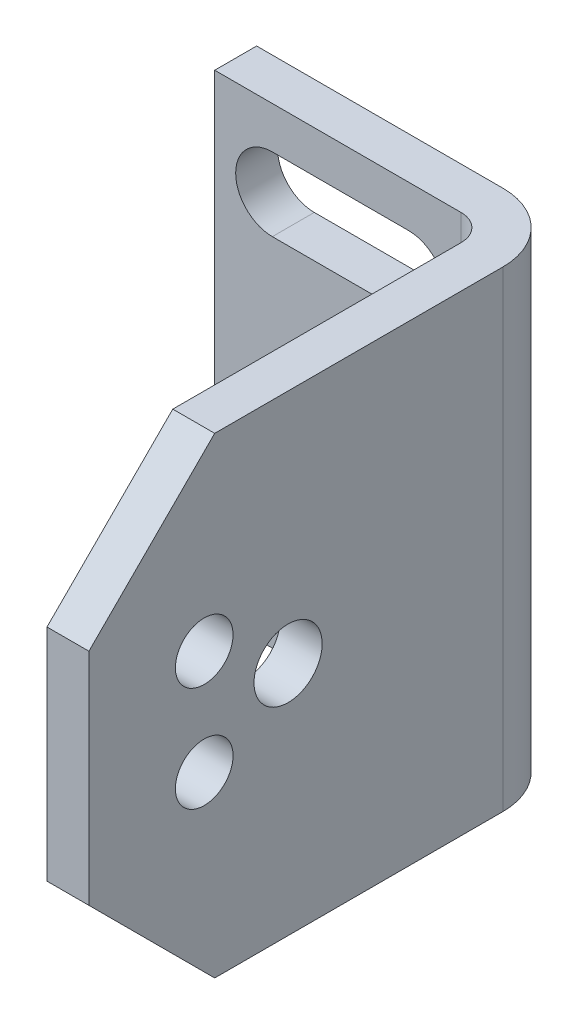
ISO-10303-21;
HEADER;
FILE_DESCRIPTION(('STEP AP214'),'2;1');
FILE_NAME('part.step','',(''),(''),'','','');
FILE_SCHEMA(('AUTOMOTIVE_DESIGN { 1 0 10303 214 1 1 1 1 }'));
ENDSEC;
DATA;
#1=APPLICATION_CONTEXT('core data for automotive mechanical design processes');
#2=APPLICATION_PROTOCOL_DEFINITION('international standard','automotive_design',2000,#1);
#3=PRODUCT_CONTEXT('',#1,'mechanical');
#4=PRODUCT('Part','Part','',(#3));
#5=PRODUCT_RELATED_PRODUCT_CATEGORY('part','',(#4));
#6=PRODUCT_DEFINITION_FORMATION('','',#4);
#7=PRODUCT_DEFINITION_CONTEXT('part definition',#1,'design');
#8=PRODUCT_DEFINITION('design','',#6,#7);
#9=PRODUCT_DEFINITION_SHAPE('','',#8);
#10=(LENGTH_UNIT() NAMED_UNIT(*) SI_UNIT(.MILLI.,.METRE.));
#11=(NAMED_UNIT(*) PLANE_ANGLE_UNIT() SI_UNIT($,.RADIAN.));
#12=(NAMED_UNIT(*) SI_UNIT($,.STERADIAN.) SOLID_ANGLE_UNIT());
#13=UNCERTAINTY_MEASURE_WITH_UNIT(LENGTH_MEASURE(1.E-05),#10,'distance_accuracy_value','');
#14=(GEOMETRIC_REPRESENTATION_CONTEXT(3) GLOBAL_UNCERTAINTY_ASSIGNED_CONTEXT((#13)) GLOBAL_UNIT_ASSIGNED_CONTEXT((#10,
#11,#12)) REPRESENTATION_CONTEXT('',''));
#15=CARTESIAN_POINT('',(0.,0.,0.));
#16=DIRECTION('',(0.,0.,1.));
#17=DIRECTION('',(1.,0.,0.));
#18=AXIS2_PLACEMENT_3D('',#15,#16,#17);
#19=CARTESIAN_POINT('',(20.5,37.5,46.));
#20=DIRECTION('',(0.,0.,-1.));
#21=DIRECTION('',(-1.,0.,0.));
#22=AXIS2_PLACEMENT_3D('',#19,#20,#21);
#23=PLANE('',#22);
#24=DIRECTION('',(0.,-1.,0.));
#25=VECTOR('',#24,1.);
#26=CARTESIAN_POINT('',(24.5,37.5,46.));
#27=LINE('',#26,#25);
#28=CARTESIAN_POINT('',(24.5,25.5,46.));
#29=VERTEX_POINT('',#28);
#30=CARTESIAN_POINT('',(24.5,4.5,46.));
#31=VERTEX_POINT('',#30);
#32=EDGE_CURVE('E252',#29,#31,#27,.T.);
#33=ORIENTED_EDGE('',*,*,#32,.F.);
#34=DIRECTION('',(-1.,0.,0.));
#35=VECTOR('',#34,1.);
#36=CARTESIAN_POINT('',(20.5,25.5,46.));
#37=LINE('',#36,#35);
#38=CARTESIAN_POINT('',(20.5,25.5,46.));
#39=VERTEX_POINT('',#38);
#40=EDGE_CURVE('E265',#29,#39,#37,.T.);
#41=ORIENTED_EDGE('',*,*,#40,.T.);
#42=DIRECTION('',(0.,-1.,0.));
#43=VECTOR('',#42,1.);
#44=CARTESIAN_POINT('',(20.5,37.5,46.));
#45=LINE('',#44,#43);
#46=CARTESIAN_POINT('',(20.5,4.5,46.));
#47=VERTEX_POINT('',#46);
#48=EDGE_CURVE('E217',#39,#47,#45,.T.);
#49=ORIENTED_EDGE('',*,*,#48,.T.);
#50=DIRECTION('',(1.,0.,0.));
#51=VECTOR('',#50,1.);
#52=CARTESIAN_POINT('',(20.5,4.5,46.));
#53=LINE('',#52,#51);
#54=EDGE_CURVE('E262',#47,#31,#53,.T.);
#55=ORIENTED_EDGE('',*,*,#54,.T.);
#56=EDGE_LOOP('',(#33,#41,#49,#55));
#57=FACE_BOUND('',#56,.T.);
#58=ADVANCED_FACE('F14',(#57),#23,.F.);
#59=CARTESIAN_POINT('',(24.5,37.5,46.));
#60=DIRECTION('',(-1.,0.,0.));
#61=DIRECTION('',(0.,0.,1.));
#62=AXIS2_PLACEMENT_3D('',#59,#60,#61);
#63=PLANE('',#62);
#64=CARTESIAN_POINT('',(24.5,10.,35.));
#65=DIRECTION('',(1.,0.,0.));
#66=DIRECTION('',(0.,-1.,0.));
#67=AXIS2_PLACEMENT_3D('',#64,#65,#66);
#68=CIRCLE('',#67,2.75);
#69=CARTESIAN_POINT('',(24.5,7.25,35.));
#70=VERTEX_POINT('',#69);
#71=EDGE_CURVE('E182',#70,#70,#68,.T.);
#72=ORIENTED_EDGE('',*,*,#71,.F.);
#73=EDGE_LOOP('',(#72));
#74=FACE_BOUND('',#73,.T.);
#75=CARTESIAN_POINT('',(24.5,20.,35.));
#76=DIRECTION('',(1.,0.,0.));
#77=DIRECTION('',(0.,1.,0.));
#78=AXIS2_PLACEMENT_3D('',#75,#76,#77);
#79=CIRCLE('',#78,2.75);
#80=CARTESIAN_POINT('',(24.5,22.75,35.));
#81=VERTEX_POINT('',#80);
#82=EDGE_CURVE('E193',#81,#81,#79,.T.);
#83=ORIENTED_EDGE('',*,*,#82,.F.);
#84=EDGE_LOOP('',(#83));
#85=FACE_BOUND('',#84,.T.);
#86=CARTESIAN_POINT('',(24.5,15.,27.));
#87=DIRECTION('',(1.,0.,0.));
#88=DIRECTION('',(0.,1.,0.));
#89=AXIS2_PLACEMENT_3D('',#86,#87,#88);
#90=CIRCLE('',#89,3.25);
#91=CARTESIAN_POINT('',(24.5,18.25,27.));
#92=VERTEX_POINT('',#91);
#93=EDGE_CURVE('E197',#92,#92,#90,.T.);
#94=ORIENTED_EDGE('',*,*,#93,.F.);
#95=EDGE_LOOP('',(#94));
#96=FACE_BOUND('',#95,.T.);
#97=DIRECTION('',(0.,0.,-1.));
#98=VECTOR('',#97,1.);
#99=CARTESIAN_POINT('',(24.5,37.5,46.));
#100=LINE('',#99,#98);
#101=CARTESIAN_POINT('',(24.5,37.5,34.));
#102=VERTEX_POINT('',#101);
#103=CARTESIAN_POINT('',(24.5,37.5,6.5));
#104=VERTEX_POINT('',#103);
#105=EDGE_CURVE('E201',#102,#104,#100,.T.);
#106=ORIENTED_EDGE('',*,*,#105,.F.);
#107=DIRECTION('',(0.,-0.707106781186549,0.707106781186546));
#108=VECTOR('',#107,1.);
#109=CARTESIAN_POINT('',(24.5,37.5,34.));
#110=LINE('',#109,#108);
#111=EDGE_CURVE('E260',#102,#29,#110,.T.);
#112=ORIENTED_EDGE('',*,*,#111,.T.);
#113=ORIENTED_EDGE('',*,*,#32,.T.);
#114=DIRECTION('',(0.,0.707106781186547,0.707106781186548));
#115=VECTOR('',#114,1.);
#116=CARTESIAN_POINT('',(24.5,4.5,46.));
#117=LINE('',#116,#115);
#118=CARTESIAN_POINT('',(24.5,-7.5,34.));
#119=VERTEX_POINT('',#118);
#120=EDGE_CURVE('E258',#31,#119,#117,.F.);
#121=ORIENTED_EDGE('',*,*,#120,.T.);
#122=DIRECTION('',(0.,0.,-1.));
#123=VECTOR('',#122,1.);
#124=CARTESIAN_POINT('',(24.5,-7.5,46.));
#125=LINE('',#124,#123);
#126=CARTESIAN_POINT('',(24.5,-7.5,6.5));
#127=VERTEX_POINT('',#126);
#128=EDGE_CURVE('E218',#119,#127,#125,.T.);
#129=ORIENTED_EDGE('',*,*,#128,.T.);
#130=DIRECTION('',(0.,-1.,0.));
#131=VECTOR('',#130,1.);
#132=CARTESIAN_POINT('',(24.5,37.5,6.5));
#133=LINE('',#132,#131);
#134=EDGE_CURVE('E249',#104,#127,#133,.T.);
#135=ORIENTED_EDGE('',*,*,#134,.F.);
#136=EDGE_LOOP('',(#106,#112,#113,#121,#129,#135));
#137=FACE_BOUND('',#136,.T.);
#138=ADVANCED_FACE('F313',(#74,#85,#96,#137),#63,.F.);
#139=CARTESIAN_POINT('',(18.,37.5,6.5));
#140=DIRECTION('',(0.,-1.,0.));
#141=DIRECTION('',(1.,0.,0.));
#142=AXIS2_PLACEMENT_3D('',#139,#140,#141);
#143=CYLINDRICAL_SURFACE('',#142,6.5);
#144=CARTESIAN_POINT('',(18.,-7.5,6.5));
#145=DIRECTION('',(0.,1.,0.));
#146=DIRECTION('',(-1.,0.,0.));
#147=AXIS2_PLACEMENT_3D('',#144,#145,#146);
#148=CIRCLE('',#147,6.5);
#149=CARTESIAN_POINT('',(18.,-7.5,0.));
#150=VERTEX_POINT('',#149);
#151=EDGE_CURVE('E220',#127,#150,#148,.T.);
#152=ORIENTED_EDGE('',*,*,#151,.T.);
#153=DIRECTION('',(0.,-1.,0.));
#154=VECTOR('',#153,1.);
#155=CARTESIAN_POINT('',(18.,37.5,0.));
#156=LINE('',#155,#154);
#157=CARTESIAN_POINT('',(18.,37.5,0.));
#158=VERTEX_POINT('',#157);
#159=EDGE_CURVE('E246',#158,#150,#156,.T.);
#160=ORIENTED_EDGE('',*,*,#159,.F.);
#161=CARTESIAN_POINT('',(18.,37.5,6.5));
#162=DIRECTION('',(0.,1.,0.));
#163=DIRECTION('',(-1.,0.,0.));
#164=AXIS2_PLACEMENT_3D('',#161,#162,#163);
#165=CIRCLE('',#164,6.5);
#166=EDGE_CURVE('E203',#104,#158,#165,.T.);
#167=ORIENTED_EDGE('',*,*,#166,.F.);
#168=ORIENTED_EDGE('',*,*,#134,.T.);
#169=EDGE_LOOP('',(#152,#160,#167,#168));
#170=FACE_BOUND('',#169,.T.);
#171=ADVANCED_FACE('F320',(#170),#143,.T.);
#172=CARTESIAN_POINT('',(18.,37.5,0.));
#173=DIRECTION('',(0.,0.,1.));
#174=DIRECTION('',(1.,0.,0.));
#175=AXIS2_PLACEMENT_3D('',#172,#173,#174);
#176=PLANE('',#175);
#177=DIRECTION('',(-1.,0.,0.));
#178=VECTOR('',#177,1.);
#179=CARTESIAN_POINT('',(13.,3.5,0.));
#180=LINE('',#179,#178);
#181=CARTESIAN_POINT('',(13.,3.5,0.));
#182=VERTEX_POINT('',#181);
#183=CARTESIAN_POINT('',(0.,3.5,0.));
#184=VERTEX_POINT('',#183);
#185=EDGE_CURVE('E146',#182,#184,#180,.T.);
#186=ORIENTED_EDGE('',*,*,#185,.T.);
#187=CARTESIAN_POINT('',(0.,0.,0.));
#188=DIRECTION('',(0.,0.,1.));
#189=DIRECTION('',(-1.,0.,0.));
#190=AXIS2_PLACEMENT_3D('',#187,#188,#189);
#191=CIRCLE('',#190,3.5);
#192=CARTESIAN_POINT('',(0.,-3.5,0.));
#193=VERTEX_POINT('',#192);
#194=EDGE_CURVE('E142',#184,#193,#191,.T.);
#195=ORIENTED_EDGE('',*,*,#194,.T.);
#196=DIRECTION('',(1.,0.,0.));
#197=VECTOR('',#196,1.);
#198=CARTESIAN_POINT('',(13.,-3.5,0.));
#199=LINE('',#198,#197);
#200=CARTESIAN_POINT('',(13.,-3.5,0.));
#201=VERTEX_POINT('',#200);
#202=EDGE_CURVE('E149',#193,#201,#199,.T.);
#203=ORIENTED_EDGE('',*,*,#202,.T.);
#204=CARTESIAN_POINT('',(13.,0.,0.));
#205=DIRECTION('',(0.,0.,1.));
#206=DIRECTION('',(-1.,0.,0.));
#207=AXIS2_PLACEMENT_3D('',#204,#205,#206);
#208=CIRCLE('',#207,3.5);
#209=EDGE_CURVE('E29',#201,#182,#208,.T.);
#210=ORIENTED_EDGE('',*,*,#209,.T.);
#211=EDGE_LOOP('',(#186,#195,#203,#210));
#212=FACE_BOUND('',#211,.T.);
#213=DIRECTION('',(1.,0.,0.));
#214=VECTOR('',#213,1.);
#215=CARTESIAN_POINT('',(13.,26.5,0.));
#216=LINE('',#215,#214);
#217=CARTESIAN_POINT('',(0.,26.5,0.));
#218=VERTEX_POINT('',#217);
#219=CARTESIAN_POINT('',(13.,26.5,0.));
#220=VERTEX_POINT('',#219);
#221=EDGE_CURVE('E175',#218,#220,#216,.T.);
#222=ORIENTED_EDGE('',*,*,#221,.T.);
#223=CARTESIAN_POINT('',(13.,30.,0.));
#224=DIRECTION('',(0.,0.,1.));
#225=DIRECTION('',(1.,0.,0.));
#226=AXIS2_PLACEMENT_3D('',#223,#224,#225);
#227=CIRCLE('',#226,3.5);
#228=CARTESIAN_POINT('',(13.,33.5,0.));
#229=VERTEX_POINT('',#228);
#230=EDGE_CURVE('E162',#220,#229,#227,.T.);
#231=ORIENTED_EDGE('',*,*,#230,.T.);
#232=DIRECTION('',(-1.,0.,0.));
#233=VECTOR('',#232,1.);
#234=CARTESIAN_POINT('',(13.,33.5,0.));
#235=LINE('',#234,#233);
#236=CARTESIAN_POINT('',(0.,33.5,0.));
#237=VERTEX_POINT('',#236);
#238=EDGE_CURVE('E169',#229,#237,#235,.T.);
#239=ORIENTED_EDGE('',*,*,#238,.T.);
#240=CARTESIAN_POINT('',(0.,30.,0.));
#241=DIRECTION('',(0.,0.,1.));
#242=DIRECTION('',(1.,0.,0.));
#243=AXIS2_PLACEMENT_3D('',#240,#241,#242);
#244=CIRCLE('',#243,3.5);
#245=EDGE_CURVE('E172',#237,#218,#244,.T.);
#246=ORIENTED_EDGE('',*,*,#245,.T.);
#247=EDGE_LOOP('',(#222,#231,#239,#246));
#248=FACE_BOUND('',#247,.T.);
#249=DIRECTION('',(-1.,0.,0.));
#250=VECTOR('',#249,1.);
#251=CARTESIAN_POINT('',(18.,-7.5,0.));
#252=LINE('',#251,#250);
#253=CARTESIAN_POINT('',(-5.5,-7.5,0.));
#254=VERTEX_POINT('',#253);
#255=EDGE_CURVE('E222',#150,#254,#252,.T.);
#256=ORIENTED_EDGE('',*,*,#255,.T.);
#257=DIRECTION('',(0.,-1.,0.));
#258=VECTOR('',#257,1.);
#259=CARTESIAN_POINT('',(-5.5,37.5,0.));
#260=LINE('',#259,#258);
#261=CARTESIAN_POINT('',(-5.5,37.5,0.));
#262=VERTEX_POINT('',#261);
#263=EDGE_CURVE('E243',#262,#254,#260,.T.);
#264=ORIENTED_EDGE('',*,*,#263,.F.);
#265=DIRECTION('',(-1.,0.,0.));
#266=VECTOR('',#265,1.);
#267=CARTESIAN_POINT('',(18.,37.5,0.));
#268=LINE('',#267,#266);
#269=EDGE_CURVE('E206',#158,#262,#268,.T.);
#270=ORIENTED_EDGE('',*,*,#269,.F.);
#271=ORIENTED_EDGE('',*,*,#159,.T.);
#272=EDGE_LOOP('',(#256,#264,#270,#271));
#273=FACE_BOUND('',#272,.T.);
#274=ADVANCED_FACE('F153',(#212,#248,#273),#176,.F.);
#275=CARTESIAN_POINT('',(-5.5,37.5,0.));
#276=DIRECTION('',(1.,0.,0.));
#277=DIRECTION('',(0.,1.,0.));
#278=AXIS2_PLACEMENT_3D('',#275,#276,#277);
#279=PLANE('',#278);
#280=DIRECTION('',(0.,0.,1.));
#281=VECTOR('',#280,1.);
#282=CARTESIAN_POINT('',(-5.5,-7.5,0.));
#283=LINE('',#282,#281);
#284=CARTESIAN_POINT('',(-5.5,-7.5,4.));
#285=VERTEX_POINT('',#284);
#286=EDGE_CURVE('E224',#254,#285,#283,.T.);
#287=ORIENTED_EDGE('',*,*,#286,.T.);
#288=DIRECTION('',(0.,-1.,0.));
#289=VECTOR('',#288,1.);
#290=CARTESIAN_POINT('',(-5.5,37.5,4.));
#291=LINE('',#290,#289);
#292=CARTESIAN_POINT('',(-5.5,37.5,4.));
#293=VERTEX_POINT('',#292);
#294=EDGE_CURVE('E240',#293,#285,#291,.T.);
#295=ORIENTED_EDGE('',*,*,#294,.F.);
#296=DIRECTION('',(0.,0.,1.));
#297=VECTOR('',#296,1.);
#298=CARTESIAN_POINT('',(-5.5,37.5,0.));
#299=LINE('',#298,#297);
#300=EDGE_CURVE('E208',#262,#293,#299,.T.);
#301=ORIENTED_EDGE('',*,*,#300,.F.);
#302=ORIENTED_EDGE('',*,*,#263,.T.);
#303=EDGE_LOOP('',(#287,#295,#301,#302));
#304=FACE_BOUND('',#303,.T.);
#305=ADVANCED_FACE('F375',(#304),#279,.F.);
#306=CARTESIAN_POINT('',(-5.5,37.5,4.));
#307=DIRECTION('',(0.,0.,-1.));
#308=DIRECTION('',(-1.,0.,0.));
#309=AXIS2_PLACEMENT_3D('',#306,#307,#308);
#310=PLANE('',#309);
#311=DIRECTION('',(-1.,0.,0.));
#312=VECTOR('',#311,1.);
#313=CARTESIAN_POINT('',(-5.5,-3.5,4.));
#314=LINE('',#313,#312);
#315=CARTESIAN_POINT('',(13.,-3.5,4.));
#316=VERTEX_POINT('',#315);
#317=CARTESIAN_POINT('',(0.,-3.5,4.));
#318=VERTEX_POINT('',#317);
#319=EDGE_CURVE('E291',#316,#318,#314,.T.);
#320=ORIENTED_EDGE('',*,*,#319,.T.);
#321=CARTESIAN_POINT('',(0.,0.,4.));
#322=DIRECTION('',(0.,0.,-1.));
#323=DIRECTION('',(-1.,0.,0.));
#324=AXIS2_PLACEMENT_3D('',#321,#322,#323);
#325=CIRCLE('',#324,3.5);
#326=CARTESIAN_POINT('',(0.,3.5,4.));
#327=VERTEX_POINT('',#326);
#328=EDGE_CURVE('E9',#318,#327,#325,.T.);
#329=ORIENTED_EDGE('',*,*,#328,.T.);
#330=DIRECTION('',(1.,0.,0.));
#331=VECTOR('',#330,1.);
#332=CARTESIAN_POINT('',(-5.5,3.5,4.));
#333=LINE('',#332,#331);
#334=CARTESIAN_POINT('',(13.,3.5,4.));
#335=VERTEX_POINT('',#334);
#336=EDGE_CURVE('E22',#327,#335,#333,.T.);
#337=ORIENTED_EDGE('',*,*,#336,.T.);
#338=CARTESIAN_POINT('',(13.,0.,4.));
#339=DIRECTION('',(0.,0.,-1.));
#340=DIRECTION('',(-1.,0.,0.));
#341=AXIS2_PLACEMENT_3D('',#338,#339,#340);
#342=CIRCLE('',#341,3.5);
#343=EDGE_CURVE('E293',#335,#316,#342,.T.);
#344=ORIENTED_EDGE('',*,*,#343,.T.);
#345=EDGE_LOOP('',(#320,#329,#337,#344));
#346=FACE_BOUND('',#345,.T.);
#347=DIRECTION('',(1.,0.,0.));
#348=VECTOR('',#347,1.);
#349=CARTESIAN_POINT('',(-5.5,33.5,4.));
#350=LINE('',#349,#348);
#351=CARTESIAN_POINT('',(0.,33.5,4.));
#352=VERTEX_POINT('',#351);
#353=CARTESIAN_POINT('',(13.,33.5,4.));
#354=VERTEX_POINT('',#353);
#355=EDGE_CURVE('E273',#352,#354,#350,.T.);
#356=ORIENTED_EDGE('',*,*,#355,.T.);
#357=CARTESIAN_POINT('',(13.,30.,4.));
#358=DIRECTION('',(0.,0.,-1.));
#359=DIRECTION('',(-1.,0.,0.));
#360=AXIS2_PLACEMENT_3D('',#357,#358,#359);
#361=CIRCLE('',#360,3.5);
#362=CARTESIAN_POINT('',(13.,26.5,4.));
#363=VERTEX_POINT('',#362);
#364=EDGE_CURVE('E288',#354,#363,#361,.T.);
#365=ORIENTED_EDGE('',*,*,#364,.T.);
#366=DIRECTION('',(-1.,0.,0.));
#367=VECTOR('',#366,1.);
#368=CARTESIAN_POINT('',(-5.5,26.5,4.));
#369=LINE('',#368,#367);
#370=CARTESIAN_POINT('',(0.,26.5,4.));
#371=VERTEX_POINT('',#370);
#372=EDGE_CURVE('E285',#363,#371,#369,.T.);
#373=ORIENTED_EDGE('',*,*,#372,.T.);
#374=CARTESIAN_POINT('',(0.,30.,4.));
#375=DIRECTION('',(0.,0.,-1.));
#376=DIRECTION('',(-1.,0.,0.));
#377=AXIS2_PLACEMENT_3D('',#374,#375,#376);
#378=CIRCLE('',#377,3.5);
#379=EDGE_CURVE('E282',#371,#352,#378,.T.);
#380=ORIENTED_EDGE('',*,*,#379,.T.);
#381=EDGE_LOOP('',(#356,#365,#373,#380));
#382=FACE_BOUND('',#381,.T.);
#383=DIRECTION('',(1.,0.,0.));
#384=VECTOR('',#383,1.);
#385=CARTESIAN_POINT('',(-5.5,-7.5,4.));
#386=LINE('',#385,#384);
#387=CARTESIAN_POINT('',(18.,-7.5,4.));
#388=VERTEX_POINT('',#387);
#389=EDGE_CURVE('E226',#285,#388,#386,.T.);
#390=ORIENTED_EDGE('',*,*,#389,.T.);
#391=DIRECTION('',(0.,-1.,0.));
#392=VECTOR('',#391,1.);
#393=CARTESIAN_POINT('',(18.,37.5,4.));
#394=LINE('',#393,#392);
#395=CARTESIAN_POINT('',(18.,37.5,4.));
#396=VERTEX_POINT('',#395);
#397=EDGE_CURVE('E237',#396,#388,#394,.T.);
#398=ORIENTED_EDGE('',*,*,#397,.F.);
#399=DIRECTION('',(1.,0.,0.));
#400=VECTOR('',#399,1.);
#401=CARTESIAN_POINT('',(-5.5,37.5,4.));
#402=LINE('',#401,#400);
#403=EDGE_CURVE('E210',#293,#396,#402,.T.);
#404=ORIENTED_EDGE('',*,*,#403,.F.);
#405=ORIENTED_EDGE('',*,*,#294,.T.);
#406=EDGE_LOOP('',(#390,#398,#404,#405));
#407=FACE_BOUND('',#406,.T.);
#408=ADVANCED_FACE('F297',(#346,#382,#407),#310,.F.);
#409=CARTESIAN_POINT('',(18.,37.5,6.5));
#410=DIRECTION('',(0.,-1.,0.));
#411=DIRECTION('',(1.,0.,0.));
#412=AXIS2_PLACEMENT_3D('',#409,#410,#411);
#413=CYLINDRICAL_SURFACE('',#412,2.5);
#414=CARTESIAN_POINT('',(18.,-7.5,6.5));
#415=DIRECTION('',(0.,-1.,0.));
#416=DIRECTION('',(-1.,0.,0.));
#417=AXIS2_PLACEMENT_3D('',#414,#415,#416);
#418=CIRCLE('',#417,2.5);
#419=CARTESIAN_POINT('',(20.5,-7.5,6.5));
#420=VERTEX_POINT('',#419);
#421=EDGE_CURVE('E228',#388,#420,#418,.T.);
#422=ORIENTED_EDGE('',*,*,#421,.T.);
#423=DIRECTION('',(0.,-1.,0.));
#424=VECTOR('',#423,1.);
#425=CARTESIAN_POINT('',(20.5,37.5,6.5));
#426=LINE('',#425,#424);
#427=CARTESIAN_POINT('',(20.5,37.5,6.5));
#428=VERTEX_POINT('',#427);
#429=EDGE_CURVE('E234',#428,#420,#426,.T.);
#430=ORIENTED_EDGE('',*,*,#429,.F.);
#431=CARTESIAN_POINT('',(18.,37.5,6.5));
#432=DIRECTION('',(0.,-1.,0.));
#433=DIRECTION('',(-1.,0.,0.));
#434=AXIS2_PLACEMENT_3D('',#431,#432,#433);
#435=CIRCLE('',#434,2.5);
#436=EDGE_CURVE('E212',#396,#428,#435,.T.);
#437=ORIENTED_EDGE('',*,*,#436,.F.);
#438=ORIENTED_EDGE('',*,*,#397,.T.);
#439=EDGE_LOOP('',(#422,#430,#437,#438));
#440=FACE_BOUND('',#439,.T.);
#441=ADVANCED_FACE('F353',(#440),#413,.F.);
#442=CARTESIAN_POINT('',(20.5,37.5,6.5));
#443=DIRECTION('',(1.,0.,0.));
#444=DIRECTION('',(0.,1.,0.));
#445=AXIS2_PLACEMENT_3D('',#442,#443,#444);
#446=PLANE('',#445);
#447=CARTESIAN_POINT('',(20.5,10.,35.));
#448=DIRECTION('',(1.,0.,0.));
#449=DIRECTION('',(0.,1.,0.));
#450=AXIS2_PLACEMENT_3D('',#447,#448,#449);
#451=CIRCLE('',#450,2.75);
#452=CARTESIAN_POINT('',(20.5,12.75,35.));
#453=VERTEX_POINT('',#452);
#454=EDGE_CURVE('E192',#453,#453,#451,.T.);
#455=ORIENTED_EDGE('',*,*,#454,.T.);
#456=EDGE_LOOP('',(#455));
#457=FACE_BOUND('',#456,.T.);
#458=CARTESIAN_POINT('',(20.5,20.,35.));
#459=DIRECTION('',(1.,0.,0.));
#460=DIRECTION('',(0.,1.,0.));
#461=AXIS2_PLACEMENT_3D('',#458,#459,#460);
#462=CIRCLE('',#461,2.75);
#463=CARTESIAN_POINT('',(20.5,22.75,35.));
#464=VERTEX_POINT('',#463);
#465=EDGE_CURVE('E196',#464,#464,#462,.T.);
#466=ORIENTED_EDGE('',*,*,#465,.T.);
#467=EDGE_LOOP('',(#466));
#468=FACE_BOUND('',#467,.T.);
#469=CARTESIAN_POINT('',(20.5,15.,27.));
#470=DIRECTION('',(1.,0.,0.));
#471=DIRECTION('',(0.,1.,0.));
#472=AXIS2_PLACEMENT_3D('',#469,#470,#471);
#473=CIRCLE('',#472,3.25);
#474=CARTESIAN_POINT('',(20.5,18.25,27.));
#475=VERTEX_POINT('',#474);
#476=EDGE_CURVE('E200',#475,#475,#473,.T.);
#477=ORIENTED_EDGE('',*,*,#476,.T.);
#478=EDGE_LOOP('',(#477));
#479=FACE_BOUND('',#478,.T.);
#480=ORIENTED_EDGE('',*,*,#48,.F.);
#481=DIRECTION('',(0.,0.707106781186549,-0.707106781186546));
#482=VECTOR('',#481,1.);
#483=CARTESIAN_POINT('',(20.5,37.5,34.));
#484=LINE('',#483,#482);
#485=CARTESIAN_POINT('',(20.5,37.5,34.));
#486=VERTEX_POINT('',#485);
#487=EDGE_CURVE('E269',#39,#486,#484,.T.);
#488=ORIENTED_EDGE('',*,*,#487,.T.);
#489=DIRECTION('',(0.,0.,1.));
#490=VECTOR('',#489,1.);
#491=CARTESIAN_POINT('',(20.5,37.5,6.5));
#492=LINE('',#491,#490);
#493=EDGE_CURVE('E214',#428,#486,#492,.T.);
#494=ORIENTED_EDGE('',*,*,#493,.F.);
#495=ORIENTED_EDGE('',*,*,#429,.T.);
#496=DIRECTION('',(0.,0.,1.));
#497=VECTOR('',#496,1.);
#498=CARTESIAN_POINT('',(20.5,-7.5,6.5));
#499=LINE('',#498,#497);
#500=CARTESIAN_POINT('',(20.5,-7.5,34.));
#501=VERTEX_POINT('',#500);
#502=EDGE_CURVE('E204',#420,#501,#499,.T.);
#503=ORIENTED_EDGE('',*,*,#502,.T.);
#504=DIRECTION('',(0.,-0.707106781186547,-0.707106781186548));
#505=VECTOR('',#504,1.);
#506=CARTESIAN_POINT('',(20.5,4.5,46.));
#507=LINE('',#506,#505);
#508=EDGE_CURVE('E267',#501,#47,#507,.F.);
#509=ORIENTED_EDGE('',*,*,#508,.T.);
#510=EDGE_LOOP('',(#480,#488,#494,#495,#503,#509));
#511=FACE_BOUND('',#510,.T.);
#512=ADVANCED_FACE('F345',(#457,#468,#479,#511),#446,.F.);
#513=CARTESIAN_POINT('',(18.,37.5,6.5));
#514=DIRECTION('',(0.,1.,0.));
#515=DIRECTION('',(-1.,0.,0.));
#516=AXIS2_PLACEMENT_3D('',#513,#514,#515);
#517=PLANE('',#516);
#518=ORIENTED_EDGE('',*,*,#493,.T.);
#519=DIRECTION('',(1.,0.,0.));
#520=VECTOR('',#519,1.);
#521=CARTESIAN_POINT('',(24.5,37.5,34.));
#522=LINE('',#521,#520);
#523=EDGE_CURVE('E255',#486,#102,#522,.T.);
#524=ORIENTED_EDGE('',*,*,#523,.T.);
#525=ORIENTED_EDGE('',*,*,#105,.T.);
#526=ORIENTED_EDGE('',*,*,#166,.T.);
#527=ORIENTED_EDGE('',*,*,#269,.T.);
#528=ORIENTED_EDGE('',*,*,#300,.T.);
#529=ORIENTED_EDGE('',*,*,#403,.T.);
#530=ORIENTED_EDGE('',*,*,#436,.T.);
#531=EDGE_LOOP('',(#518,#524,#525,#526,#527,#528,#529,#530));
#532=FACE_BOUND('',#531,.T.);
#533=ADVANCED_FACE('F336',(#532),#517,.T.);
#534=CARTESIAN_POINT('',(18.,-7.5,6.5));
#535=DIRECTION('',(0.,1.,0.));
#536=DIRECTION('',(-1.,0.,0.));
#537=AXIS2_PLACEMENT_3D('',#534,#535,#536);
#538=PLANE('',#537);
#539=ORIENTED_EDGE('',*,*,#128,.F.);
#540=DIRECTION('',(-1.,0.,0.));
#541=VECTOR('',#540,1.);
#542=CARTESIAN_POINT('',(18.,-7.5,34.));
#543=LINE('',#542,#541);
#544=EDGE_CURVE('E271',#119,#501,#543,.T.);
#545=ORIENTED_EDGE('',*,*,#544,.T.);
#546=ORIENTED_EDGE('',*,*,#502,.F.);
#547=ORIENTED_EDGE('',*,*,#421,.F.);
#548=ORIENTED_EDGE('',*,*,#389,.F.);
#549=ORIENTED_EDGE('',*,*,#286,.F.);
#550=ORIENTED_EDGE('',*,*,#255,.F.);
#551=ORIENTED_EDGE('',*,*,#151,.F.);
#552=EDGE_LOOP('',(#539,#545,#546,#547,#548,#549,#550,#551));
#553=FACE_BOUND('',#552,.T.);
#554=ADVANCED_FACE('F327',(#553),#538,.F.);
#555=CARTESIAN_POINT('',(18.,37.5,34.));
#556=DIRECTION('',(0.,0.707106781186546,0.707106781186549));
#557=DIRECTION('',(0.,-0.707106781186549,0.707106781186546));
#558=AXIS2_PLACEMENT_3D('',#555,#556,#557);
#559=PLANE('',#558);
#560=ORIENTED_EDGE('',*,*,#487,.F.);
#561=ORIENTED_EDGE('',*,*,#40,.F.);
#562=ORIENTED_EDGE('',*,*,#111,.F.);
#563=ORIENTED_EDGE('',*,*,#523,.F.);
#564=EDGE_LOOP('',(#560,#561,#562,#563));
#565=FACE_BOUND('',#564,.T.);
#566=ADVANCED_FACE('F325',(#565),#559,.T.);
#567=CARTESIAN_POINT('',(20.5,4.5,46.));
#568=DIRECTION('',(0.,0.707106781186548,-0.707106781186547));
#569=DIRECTION('',(0.,0.707106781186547,0.707106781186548));
#570=AXIS2_PLACEMENT_3D('',#567,#568,#569);
#571=PLANE('',#570);
#572=ORIENTED_EDGE('',*,*,#508,.F.);
#573=ORIENTED_EDGE('',*,*,#544,.F.);
#574=ORIENTED_EDGE('',*,*,#120,.F.);
#575=ORIENTED_EDGE('',*,*,#54,.F.);
#576=EDGE_LOOP('',(#572,#573,#574,#575));
#577=FACE_BOUND('',#576,.T.);
#578=ADVANCED_FACE('F16',(#577),#571,.F.);
#579=CARTESIAN_POINT('',(-5.5,15.,27.));
#580=DIRECTION('',(1.,0.,0.));
#581=DIRECTION('',(0.,1.,0.));
#582=AXIS2_PLACEMENT_3D('',#579,#580,#581);
#583=CYLINDRICAL_SURFACE('',#582,3.25);
#584=ORIENTED_EDGE('',*,*,#93,.T.);
#585=EDGE_LOOP('',(#584));
#586=FACE_BOUND('',#585,.T.);
#587=ORIENTED_EDGE('',*,*,#476,.F.);
#588=EDGE_LOOP('',(#587));
#589=FACE_BOUND('',#588,.T.);
#590=ADVANCED_FACE('F334',(#586,#589),#583,.F.);
#591=CARTESIAN_POINT('',(-5.5,20.,35.));
#592=DIRECTION('',(1.,0.,0.));
#593=DIRECTION('',(0.,1.,0.));
#594=AXIS2_PLACEMENT_3D('',#591,#592,#593);
#595=CYLINDRICAL_SURFACE('',#594,2.75);
#596=ORIENTED_EDGE('',*,*,#82,.T.);
#597=EDGE_LOOP('',(#596));
#598=FACE_BOUND('',#597,.T.);
#599=ORIENTED_EDGE('',*,*,#465,.F.);
#600=EDGE_LOOP('',(#599));
#601=FACE_BOUND('',#600,.T.);
#602=ADVANCED_FACE('F517',(#598,#601),#595,.F.);
#603=CARTESIAN_POINT('',(-5.5,10.,35.));
#604=DIRECTION('',(1.,0.,0.));
#605=DIRECTION('',(0.,1.,0.));
#606=AXIS2_PLACEMENT_3D('',#603,#604,#605);
#607=CYLINDRICAL_SURFACE('',#606,2.75);
#608=ORIENTED_EDGE('',*,*,#71,.T.);
#609=EDGE_LOOP('',(#608));
#610=FACE_BOUND('',#609,.T.);
#611=ORIENTED_EDGE('',*,*,#454,.F.);
#612=EDGE_LOOP('',(#611));
#613=FACE_BOUND('',#612,.T.);
#614=ADVANCED_FACE('F508',(#610,#613),#607,.F.);
#615=CARTESIAN_POINT('',(13.,30.,0.));
#616=DIRECTION('',(0.,0.,1.));
#617=DIRECTION('',(1.,0.,0.));
#618=AXIS2_PLACEMENT_3D('',#615,#616,#617);
#619=CYLINDRICAL_SURFACE('',#618,3.5);
#620=DIRECTION('',(0.,0.,1.));
#621=VECTOR('',#620,1.);
#622=CARTESIAN_POINT('',(13.,33.5,0.));
#623=LINE('',#622,#621);
#624=EDGE_CURVE('E178',#229,#354,#623,.T.);
#625=ORIENTED_EDGE('',*,*,#624,.F.);
#626=ORIENTED_EDGE('',*,*,#230,.F.);
#627=DIRECTION('',(0.,0.,1.));
#628=VECTOR('',#627,1.);
#629=CARTESIAN_POINT('',(13.,26.5,0.));
#630=LINE('',#629,#628);
#631=EDGE_CURVE('E179',#220,#363,#630,.T.);
#632=ORIENTED_EDGE('',*,*,#631,.T.);
#633=ORIENTED_EDGE('',*,*,#364,.F.);
#634=EDGE_LOOP('',(#625,#626,#632,#633));
#635=FACE_BOUND('',#634,.T.);
#636=ADVANCED_FACE('F499',(#635),#619,.F.);
#637=CARTESIAN_POINT('',(13.,26.5,0.));
#638=DIRECTION('',(0.,-1.,0.));
#639=DIRECTION('',(1.,0.,0.));
#640=AXIS2_PLACEMENT_3D('',#637,#638,#639);
#641=PLANE('',#640);
#642=ORIENTED_EDGE('',*,*,#631,.F.);
#643=ORIENTED_EDGE('',*,*,#221,.F.);
#644=DIRECTION('',(0.,0.,1.));
#645=VECTOR('',#644,1.);
#646=CARTESIAN_POINT('',(0.,26.5,0.));
#647=LINE('',#646,#645);
#648=EDGE_CURVE('E183',#218,#371,#647,.T.);
#649=ORIENTED_EDGE('',*,*,#648,.T.);
#650=ORIENTED_EDGE('',*,*,#372,.F.);
#651=EDGE_LOOP('',(#642,#643,#649,#650));
#652=FACE_BOUND('',#651,.T.);
#653=ADVANCED_FACE('F490',(#652),#641,.F.);
#654=CARTESIAN_POINT('',(0.,30.,0.));
#655=DIRECTION('',(0.,0.,1.));
#656=DIRECTION('',(1.,0.,0.));
#657=AXIS2_PLACEMENT_3D('',#654,#655,#656);
#658=CYLINDRICAL_SURFACE('',#657,3.5);
#659=ORIENTED_EDGE('',*,*,#648,.F.);
#660=ORIENTED_EDGE('',*,*,#245,.F.);
#661=DIRECTION('',(0.,0.,1.));
#662=VECTOR('',#661,1.);
#663=CARTESIAN_POINT('',(0.,33.5,0.));
#664=LINE('',#663,#662);
#665=EDGE_CURVE('E186',#237,#352,#664,.T.);
#666=ORIENTED_EDGE('',*,*,#665,.T.);
#667=ORIENTED_EDGE('',*,*,#379,.F.);
#668=EDGE_LOOP('',(#659,#660,#666,#667));
#669=FACE_BOUND('',#668,.T.);
#670=ADVANCED_FACE('F481',(#669),#658,.F.);
#671=CARTESIAN_POINT('',(13.,33.5,0.));
#672=DIRECTION('',(0.,1.,0.));
#673=DIRECTION('',(-1.,0.,0.));
#674=AXIS2_PLACEMENT_3D('',#671,#672,#673);
#675=PLANE('',#674);
#676=ORIENTED_EDGE('',*,*,#665,.F.);
#677=ORIENTED_EDGE('',*,*,#238,.F.);
#678=ORIENTED_EDGE('',*,*,#624,.T.);
#679=ORIENTED_EDGE('',*,*,#355,.F.);
#680=EDGE_LOOP('',(#676,#677,#678,#679));
#681=FACE_BOUND('',#680,.T.);
#682=ADVANCED_FACE('F474',(#681),#675,.F.);
#683=CARTESIAN_POINT('',(0.,0.,0.));
#684=DIRECTION('',(0.,0.,1.));
#685=DIRECTION('',(1.,0.,0.));
#686=AXIS2_PLACEMENT_3D('',#683,#684,#685);
#687=CYLINDRICAL_SURFACE('',#686,3.5);
#688=DIRECTION('',(0.,0.,1.));
#689=VECTOR('',#688,1.);
#690=CARTESIAN_POINT('',(0.,-3.5,0.));
#691=LINE('',#690,#689);
#692=EDGE_CURVE('E37',#193,#318,#691,.T.);
#693=ORIENTED_EDGE('',*,*,#692,.F.);
#694=ORIENTED_EDGE('',*,*,#194,.F.);
#695=DIRECTION('',(0.,0.,1.));
#696=VECTOR('',#695,1.);
#697=CARTESIAN_POINT('',(0.,3.5,0.));
#698=LINE('',#697,#696);
#699=EDGE_CURVE('E160',#184,#327,#698,.T.);
#700=ORIENTED_EDGE('',*,*,#699,.T.);
#701=ORIENTED_EDGE('',*,*,#328,.F.);
#702=EDGE_LOOP('',(#693,#694,#700,#701));
#703=FACE_BOUND('',#702,.T.);
#704=ADVANCED_FACE('F139',(#703),#687,.F.);
#705=CARTESIAN_POINT('',(13.,3.5,0.));
#706=DIRECTION('',(0.,1.,0.));
#707=DIRECTION('',(-1.,0.,0.));
#708=AXIS2_PLACEMENT_3D('',#705,#706,#707);
#709=PLANE('',#708);
#710=ORIENTED_EDGE('',*,*,#699,.F.);
#711=ORIENTED_EDGE('',*,*,#185,.F.);
#712=DIRECTION('',(0.,0.,1.));
#713=VECTOR('',#712,1.);
#714=CARTESIAN_POINT('',(13.,3.5,0.));
#715=LINE('',#714,#713);
#716=EDGE_CURVE('E163',#182,#335,#715,.T.);
#717=ORIENTED_EDGE('',*,*,#716,.T.);
#718=ORIENTED_EDGE('',*,*,#336,.F.);
#719=EDGE_LOOP('',(#710,#711,#717,#718));
#720=FACE_BOUND('',#719,.T.);
#721=ADVANCED_FACE('F300',(#720),#709,.F.);
#722=CARTESIAN_POINT('',(13.,0.,0.));
#723=DIRECTION('',(0.,0.,1.));
#724=DIRECTION('',(1.,0.,0.));
#725=AXIS2_PLACEMENT_3D('',#722,#723,#724);
#726=CYLINDRICAL_SURFACE('',#725,3.5);
#727=ORIENTED_EDGE('',*,*,#716,.F.);
#728=ORIENTED_EDGE('',*,*,#209,.F.);
#729=DIRECTION('',(0.,0.,1.));
#730=VECTOR('',#729,1.);
#731=CARTESIAN_POINT('',(13.,-3.5,0.));
#732=LINE('',#731,#730);
#733=EDGE_CURVE('E145',#201,#316,#732,.T.);
#734=ORIENTED_EDGE('',*,*,#733,.T.);
#735=ORIENTED_EDGE('',*,*,#343,.F.);
#736=EDGE_LOOP('',(#727,#728,#734,#735));
#737=FACE_BOUND('',#736,.T.);
#738=ADVANCED_FACE('F301',(#737),#726,.F.);
#739=CARTESIAN_POINT('',(13.,-3.5,0.));
#740=DIRECTION('',(0.,-1.,0.));
#741=DIRECTION('',(1.,0.,0.));
#742=AXIS2_PLACEMENT_3D('',#739,#740,#741);
#743=PLANE('',#742);
#744=ORIENTED_EDGE('',*,*,#733,.F.);
#745=ORIENTED_EDGE('',*,*,#202,.F.);
#746=ORIENTED_EDGE('',*,*,#692,.T.);
#747=ORIENTED_EDGE('',*,*,#319,.F.);
#748=EDGE_LOOP('',(#744,#745,#746,#747));
#749=FACE_BOUND('',#748,.T.);
#750=ADVANCED_FACE('F150',(#749),#743,.F.);
#751=CLOSED_SHELL('',(#58,#138,#171,#274,#305,#408,#441,#512,#533,#554,#566,#578,#590,#602,#614,
#636,#653,#670,#682,#704,#721,#738,#750));
#752=MANIFOLD_SOLID_BREP('B1',#751);
#753=ADVANCED_BREP_SHAPE_REPRESENTATION('',(#18,#752),#14);
#754=SHAPE_DEFINITION_REPRESENTATION(#9,#753);
ENDSEC;
END-ISO-10303-21;
